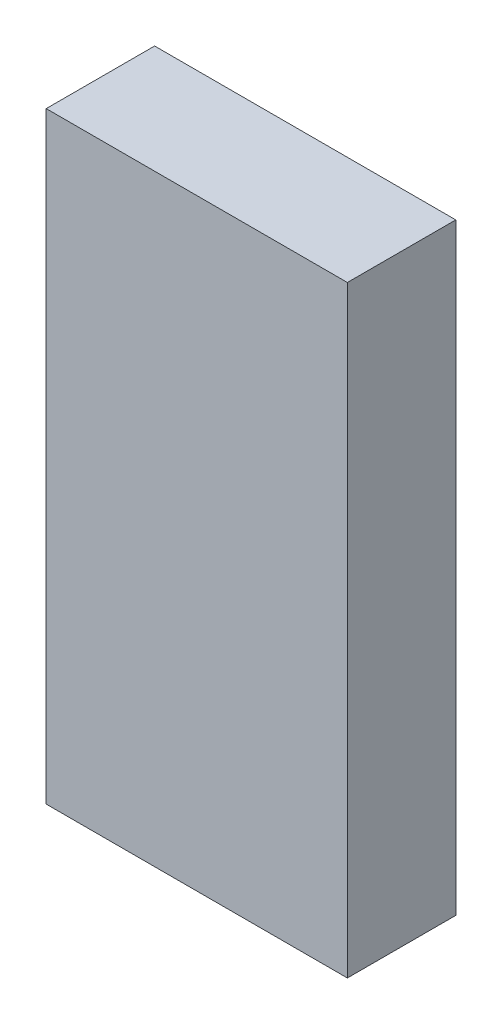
from build123d import *

# Parameters (mm, degrees)
SKETCH1_W           = 100
SKETCH1_H           = 200
BOSS_EXTRUDE1_DEPTH = 36
SKETCH4_W           = 70
SKETCH4_H           = 170
CUT_EXTRUDE1_DEPTH  = 28
FILLET1_R           = 10
SKETCH5_W           = 90
SKETCH5_H           = 190
CUT_EXTRUDE2_DEPTH  = 5


with BuildPart() as part:
    # Sketch1 → Boss-Extrude1 (new body)
    with BuildSketch(Plane.XY):
        Rectangle(SKETCH1_W, SKETCH1_H)
    extrude(amount=BOSS_EXTRUDE1_DEPTH)

    # Sketch4 → Cut-Extrude1 (cut)
    with BuildSketch(Plane(origin=(0, 0, 0), x_dir=(-1, 0, 0), z_dir=(0, 0, -1))):
        Rectangle(SKETCH4_W, SKETCH4_H)
    extrude(amount=-CUT_EXTRUDE1_DEPTH, mode=Mode.SUBTRACT)

    # Fillet1
    fillet1_edges = [part.edges().sort_by_distance(p)[0] for p in [
        (-35, 0, 28),
        (-35, 85, 14),
        (0, -85, 28),
        (-35, -85, 14),
        (35, 0, 28),
        (35, -85, 14),
        (0, 85, 28),
        (35, 85, 14),
    ]]
    fillet(fillet1_edges, radius=FILLET1_R)

    # Sketch5 → Cut-Extrude2 (cut)
    with BuildSketch(Plane(origin=(0, 0, 0), x_dir=(-1, 0, 0), z_dir=(0, 0, -1))):
        Rectangle(SKETCH5_W, SKETCH5_H)
    extrude(amount=-CUT_EXTRUDE2_DEPTH, mode=Mode.SUBTRACT)


solid = part.part
